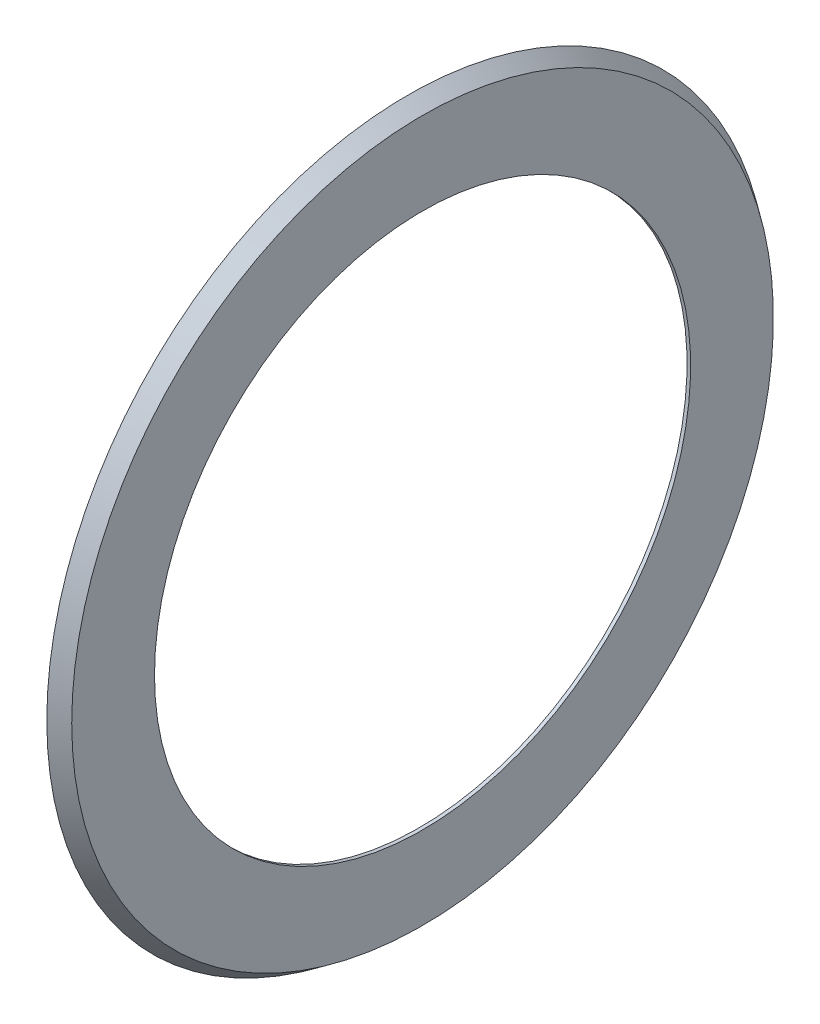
from build123d import *


with BuildPart() as part:
    # Esquisse1 → R_volution1 (revolve)
    with BuildSketch(Plane.XY, mode=Mode.PRIVATE) as r_volution1_sk:
        Polygon((9, 14.494), (9.85, 13.898823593), (9.85, 11.254), (10, 11.254), (10, 14.729032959), (9.384515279, 15.16), align=None)
    revolve(r_volution1_sk.sketch.rotate(Axis((10, 0, 0), (-1, 0, 0)), 270), axis=Axis((10, 0, 0), (-1, 0, 0)))


solid = part.part
